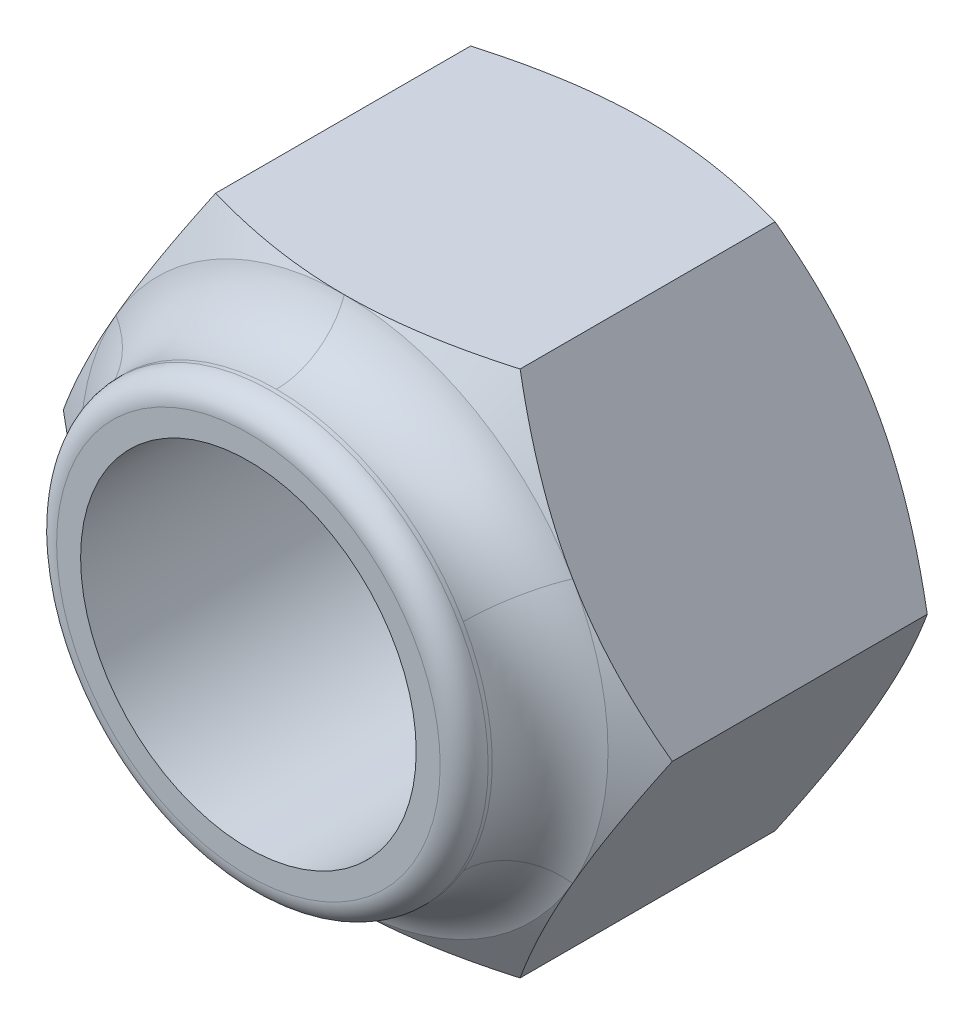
ISO-10303-21;
HEADER;
FILE_DESCRIPTION(('STEP AP214'),'2;1');
FILE_NAME('part.step','',(''),(''),'','','');
FILE_SCHEMA(('AUTOMOTIVE_DESIGN { 1 0 10303 214 1 1 1 1 }'));
ENDSEC;
DATA;
#1=APPLICATION_CONTEXT('core data for automotive mechanical design processes');
#2=APPLICATION_PROTOCOL_DEFINITION('international standard','automotive_design',2000,#1);
#3=PRODUCT_CONTEXT('',#1,'mechanical');
#4=PRODUCT('Part','Part','',(#3));
#5=PRODUCT_RELATED_PRODUCT_CATEGORY('part','',(#4));
#6=PRODUCT_DEFINITION_FORMATION('','',#4);
#7=PRODUCT_DEFINITION_CONTEXT('part definition',#1,'design');
#8=PRODUCT_DEFINITION('design','',#6,#7);
#9=PRODUCT_DEFINITION_SHAPE('','',#8);
#10=(LENGTH_UNIT() NAMED_UNIT(*) SI_UNIT(.MILLI.,.METRE.));
#11=(NAMED_UNIT(*) PLANE_ANGLE_UNIT() SI_UNIT($,.RADIAN.));
#12=(NAMED_UNIT(*) SI_UNIT($,.STERADIAN.) SOLID_ANGLE_UNIT());
#13=UNCERTAINTY_MEASURE_WITH_UNIT(LENGTH_MEASURE(1.E-05),#10,'distance_accuracy_value','');
#14=(GEOMETRIC_REPRESENTATION_CONTEXT(3) GLOBAL_UNCERTAINTY_ASSIGNED_CONTEXT((#13)) GLOBAL_UNIT_ASSIGNED_CONTEXT((#10,
#11,#12)) REPRESENTATION_CONTEXT('',''));
#15=CARTESIAN_POINT('',(0.,0.,0.));
#16=DIRECTION('',(0.,0.,1.));
#17=DIRECTION('',(1.,0.,0.));
#18=AXIS2_PLACEMENT_3D('',#15,#16,#17);
#19=CARTESIAN_POINT('',(-12.7017059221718,0.,12.6));
#20=DIRECTION('',(-0.866025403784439,0.5,0.));
#21=DIRECTION('',(-0.5,-0.866025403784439,0.));
#22=AXIS2_PLACEMENT_3D('',#19,#20,#21);
#23=PLANE('',#22);
#24=DIRECTION('',(0.,0.,-1.));
#25=VECTOR('',#24,1.);
#26=CARTESIAN_POINT('',(-12.7017059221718,0.,12.6));
#27=LINE('',#26,#25);
#28=CARTESIAN_POINT('',(-12.7017059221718,0.,11.6175196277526));
#29=VERTEX_POINT('',#28);
#30=CARTESIAN_POINT('',(-12.7017059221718,0.,0.982480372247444));
#31=VERTEX_POINT('',#30);
#32=EDGE_CURVE('E167',#29,#31,#27,.T.);
#33=ORIENTED_EDGE('',*,*,#32,.F.);
#34=CARTESIAN_POINT('',(-12.7018213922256,-0.000200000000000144,11.6174529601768));
#35=CARTESIAN_POINT('',(-12.5622159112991,0.241603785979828,11.6980408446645));
#36=CARTESIAN_POINT('',(-12.4220899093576,0.484309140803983,11.7749710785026));
#37=CARTESIAN_POINT('',(-12.1407142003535,0.971666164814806,11.9205013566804));
#38=CARTESIAN_POINT('',(-11.999464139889,1.21631844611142,11.9890986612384));
#39=CARTESIAN_POINT('',(-11.5734380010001,1.9542173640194,12.1810636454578));
#40=CARTESIAN_POINT('',(-11.2869801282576,2.45037695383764,12.2902522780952));
#41=CARTESIAN_POINT('',(-10.8583090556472,3.19285703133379,12.4182858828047));
#42=CARTESIAN_POINT('',(-10.7173765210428,3.43695934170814,12.4547577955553));
#43=CARTESIAN_POINT('',(-10.4348589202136,3.92629418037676,12.515918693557));
#44=CARTESIAN_POINT('',(-10.2932738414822,4.17152673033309,12.5406074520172));
#45=CARTESIAN_POINT('',(-10.0098676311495,4.66240068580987,12.5775696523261));
#46=CARTESIAN_POINT('',(-9.86804698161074,4.9080412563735,12.5898578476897));
#47=CARTESIAN_POINT('',(-9.58427426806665,5.39955001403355,12.6017570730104));
#48=CARTESIAN_POINT('',(-9.44232220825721,5.64541819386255,12.6013684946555));
#49=CARTESIAN_POINT('',(-9.17694200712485,6.10507018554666,12.5887988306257));
#50=CARTESIAN_POINT('',(-9.05349494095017,6.31888677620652,12.5781509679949));
#51=CARTESIAN_POINT('',(-8.80688473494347,6.74602818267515,12.5474683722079));
#52=CARTESIAN_POINT('',(-8.68372161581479,6.95935296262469,12.5274329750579));
#53=CARTESIAN_POINT('',(-8.43774623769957,7.3853948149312,12.4783246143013));
#54=CARTESIAN_POINT('',(-8.31493435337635,7.5981112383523,12.449244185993));
#55=CARTESIAN_POINT('',(-8.0698863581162,8.02254681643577,12.3825560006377));
#56=CARTESIAN_POINT('',(-7.94765028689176,8.23426590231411,12.3449476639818));
#57=CARTESIAN_POINT('',(-7.57659579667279,8.87695113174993,12.2183800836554));
#58=CARTESIAN_POINT('',(-7.32885191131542,9.30605612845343,12.1168005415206));
#59=CARTESIAN_POINT('',(-6.83705838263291,10.1578675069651,11.8862563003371));
#60=CARTESIAN_POINT('',(-6.59300244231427,10.580584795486,11.7573457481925));
#61=CARTESIAN_POINT('',(-6.35073749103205,11.0002,11.6174529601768));
#62=B_SPLINE_CURVE_WITH_KNOTS('',3,(#34,#35,#36,#37,#38,#39,#40,#41,#42,#43,#44,#45,#46,#47,#48,
#49,#50,#51,#52,#53,#54,#55,#56,#57,#58,#59,#60,#61),.UNSPECIFIED.,.F.,.F.,(4,2,2,2,2,2,2,2,2,2,
2,2,2,4),(0.,0.871755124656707,1.74379610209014,3.49159027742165,4.34403665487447,
5.19649943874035,6.0479468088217,6.89936787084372,7.64056020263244,8.38180496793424,
9.1236630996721,9.86557166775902,11.3820155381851,12.8954827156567),.UNSPECIFIED.);
#63=CARTESIAN_POINT('',(-9.52627944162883,5.5,12.6));
#64=VERTEX_POINT('',#63);
#65=EDGE_CURVE('E147',#29,#64,#62,.T.);
#66=ORIENTED_EDGE('',*,*,#65,.T.);
#67=CARTESIAN_POINT('',(-6.35085296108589,11.,11.6175196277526));
#68=VERTEX_POINT('',#67);
#69=EDGE_CURVE('E137',#64,#68,#62,.T.);
#70=ORIENTED_EDGE('',*,*,#69,.T.);
#71=DIRECTION('',(0.,0.,-1.));
#72=VECTOR('',#71,1.);
#73=CARTESIAN_POINT('',(-6.35085296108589,11.,12.6));
#74=LINE('',#73,#72);
#75=CARTESIAN_POINT('',(-6.35085296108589,11.,0.982480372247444));
#76=VERTEX_POINT('',#75);
#77=EDGE_CURVE('E308',#68,#76,#74,.T.);
#78=ORIENTED_EDGE('',*,*,#77,.T.);
#79=CARTESIAN_POINT('',(-6.35073749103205,11.0002,0.982547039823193));
#80=CARTESIAN_POINT('',(-6.49034297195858,10.7583962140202,0.901959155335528));
#81=CARTESIAN_POINT('',(-6.63046897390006,10.515690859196,0.825028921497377));
#82=CARTESIAN_POINT('',(-6.91184468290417,10.0283338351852,0.679498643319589));
#83=CARTESIAN_POINT('',(-7.05309474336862,9.78368155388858,0.610901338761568));
#84=CARTESIAN_POINT('',(-7.47912088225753,9.0457826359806,0.418936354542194));
#85=CARTESIAN_POINT('',(-7.76557875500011,8.54962304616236,0.309747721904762));
#86=CARTESIAN_POINT('',(-8.19424982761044,7.80714296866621,0.181714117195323));
#87=CARTESIAN_POINT('',(-8.33518236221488,7.56304065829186,0.145242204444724));
#88=CARTESIAN_POINT('',(-8.61769996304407,7.07370581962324,0.0840813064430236));
#89=CARTESIAN_POINT('',(-8.75928504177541,6.82847326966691,0.0593925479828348));
#90=CARTESIAN_POINT('',(-9.04269125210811,6.33759931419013,0.0224303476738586));
#91=CARTESIAN_POINT('',(-9.18451190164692,6.0919587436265,0.0101421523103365));
#92=CARTESIAN_POINT('',(-9.468284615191,5.60044998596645,-0.0017570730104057));
#93=CARTESIAN_POINT('',(-9.61023667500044,5.35458180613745,-0.00136849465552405));
#94=CARTESIAN_POINT('',(-9.87561687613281,4.89492981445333,0.0112011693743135));
#95=CARTESIAN_POINT('',(-9.99906394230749,4.68111322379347,0.02184903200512));
#96=CARTESIAN_POINT('',(-10.2456741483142,4.25397181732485,0.0525316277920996));
#97=CARTESIAN_POINT('',(-10.3688372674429,4.04064703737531,0.072567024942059));
#98=CARTESIAN_POINT('',(-10.6148126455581,3.6146051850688,0.121675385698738));
#99=CARTESIAN_POINT('',(-10.7376245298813,3.4018887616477,0.150755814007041));
#100=CARTESIAN_POINT('',(-10.9826725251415,2.97745318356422,0.2174439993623));
#101=CARTESIAN_POINT('',(-11.1049085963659,2.76573409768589,0.255052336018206));
#102=CARTESIAN_POINT('',(-11.4759630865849,2.12304886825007,0.381619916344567));
#103=CARTESIAN_POINT('',(-11.7237069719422,1.69394387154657,0.483199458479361));
#104=CARTESIAN_POINT('',(-12.2155005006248,0.84213249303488,0.713743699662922));
#105=CARTESIAN_POINT('',(-12.4595564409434,0.419415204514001,0.842654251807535));
#106=CARTESIAN_POINT('',(-12.7018213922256,-0.000199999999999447,0.982547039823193));
#107=B_SPLINE_CURVE_WITH_KNOTS('',3,(#79,#80,#81,#82,#83,#84,#85,#86,#87,#88,#89,#90,#91,#92,
#93,#94,#95,#96,#97,#98,#99,#100,#101,#102,#103,#104,#105,#106),.UNSPECIFIED.,.F.,.F.,(4,2,2,2,
2,2,2,2,2,2,2,2,2,4),(0.,0.871755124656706,1.74379610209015,3.49159027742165,4.34403665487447,
5.19649943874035,6.0479468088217,6.89936787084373,7.64056020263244,8.38180496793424,
9.1236630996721,9.86557166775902,11.3820155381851,12.8954827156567),.UNSPECIFIED.);
#108=CARTESIAN_POINT('',(-9.52627944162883,5.5,0.));
#109=VERTEX_POINT('',#108);
#110=EDGE_CURVE('E304',#76,#109,#107,.T.);
#111=ORIENTED_EDGE('',*,*,#110,.T.);
#112=EDGE_CURVE('E299',#109,#31,#107,.T.);
#113=ORIENTED_EDGE('',*,*,#112,.T.);
#114=EDGE_LOOP('',(#33,#66,#70,#78,#111,#113));
#115=FACE_BOUND('',#114,.T.);
#116=ADVANCED_FACE('F30',(#115),#23,.T.);
#117=CARTESIAN_POINT('',(-6.35085296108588,-11.,12.6));
#118=DIRECTION('',(-0.866025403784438,-0.5,0.));
#119=DIRECTION('',(0.5,-0.866025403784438,0.));
#120=AXIS2_PLACEMENT_3D('',#117,#118,#119);
#121=PLANE('',#120);
#122=DIRECTION('',(0.,0.,-1.));
#123=VECTOR('',#122,1.);
#124=CARTESIAN_POINT('',(-6.35085296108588,-11.,12.6));
#125=LINE('',#124,#123);
#126=CARTESIAN_POINT('',(-6.35085296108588,-11.,11.6175196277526));
#127=VERTEX_POINT('',#126);
#128=CARTESIAN_POINT('',(-6.35085296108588,-11.,0.982480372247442));
#129=VERTEX_POINT('',#128);
#130=EDGE_CURVE('E310',#127,#129,#125,.T.);
#131=ORIENTED_EDGE('',*,*,#130,.F.);
#132=CARTESIAN_POINT('',(-6.35073749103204,-11.0002,11.6174529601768));
#133=CARTESIAN_POINT('',(-6.49034297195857,-10.7583962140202,11.6980408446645));
#134=CARTESIAN_POINT('',(-6.63046897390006,-10.515690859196,11.7749710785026));
#135=CARTESIAN_POINT('',(-6.91184468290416,-10.0283338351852,11.9205013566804));
#136=CARTESIAN_POINT('',(-7.05309474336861,-9.78368155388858,11.9890986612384));
#137=CARTESIAN_POINT('',(-7.47912088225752,-9.0457826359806,12.1810636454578));
#138=CARTESIAN_POINT('',(-7.7655787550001,-8.54962304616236,12.2902522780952));
#139=CARTESIAN_POINT('',(-8.19424982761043,-7.80714296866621,12.4182858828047));
#140=CARTESIAN_POINT('',(-8.33518236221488,-7.56304065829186,12.4547577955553));
#141=CARTESIAN_POINT('',(-8.61769996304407,-7.07370581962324,12.515918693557));
#142=CARTESIAN_POINT('',(-8.75928504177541,-6.82847326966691,12.5406074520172));
#143=CARTESIAN_POINT('',(-9.04269125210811,-6.33759931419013,12.5775696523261));
#144=CARTESIAN_POINT('',(-9.18451190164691,-6.0919587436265,12.5898578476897));
#145=CARTESIAN_POINT('',(-9.468284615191,-5.60044998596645,12.6017570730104));
#146=CARTESIAN_POINT('',(-9.61023667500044,-5.35458180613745,12.6013684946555));
#147=CARTESIAN_POINT('',(-9.87561687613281,-4.89492981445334,12.5887988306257));
#148=CARTESIAN_POINT('',(-9.99906394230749,-4.68111322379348,12.5781509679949));
#149=CARTESIAN_POINT('',(-10.2456741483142,-4.25397181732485,12.5474683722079));
#150=CARTESIAN_POINT('',(-10.3688372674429,-4.04064703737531,12.5274329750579));
#151=CARTESIAN_POINT('',(-10.6148126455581,-3.6146051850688,12.4783246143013));
#152=CARTESIAN_POINT('',(-10.7376245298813,-3.4018887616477,12.449244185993));
#153=CARTESIAN_POINT('',(-10.9826725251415,-2.97745318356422,12.3825560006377));
#154=CARTESIAN_POINT('',(-11.1049085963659,-2.76573409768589,12.3449476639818));
#155=CARTESIAN_POINT('',(-11.4759630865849,-2.12304886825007,12.2183800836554));
#156=CARTESIAN_POINT('',(-11.7237069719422,-1.69394387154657,12.1168005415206));
#157=CARTESIAN_POINT('',(-12.2155005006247,-0.842132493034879,11.8862563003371));
#158=CARTESIAN_POINT('',(-12.4595564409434,-0.419415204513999,11.7573457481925));
#159=CARTESIAN_POINT('',(-12.7018213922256,0.000199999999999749,11.6174529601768));
#160=B_SPLINE_CURVE_WITH_KNOTS('',3,(#132,#133,#134,#135,#136,#137,#138,#139,#140,#141,#142,
#143,#144,#145,#146,#147,#148,#149,#150,#151,#152,#153,#154,#155,#156,#157,#158,#159),
.UNSPECIFIED.,.F.,.F.,(4,2,2,2,2,2,2,2,2,2,2,2,2,4),(0.,0.871755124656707,1.74379610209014,
3.49159027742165,4.34403665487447,5.19649943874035,6.0479468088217,6.89936787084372,
7.64056020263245,8.38180496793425,9.1236630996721,9.86557166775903,11.3820155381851,
12.8954827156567),.UNSPECIFIED.);
#161=CARTESIAN_POINT('',(-9.52627944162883,-5.50000000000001,12.6));
#162=VERTEX_POINT('',#161);
#163=EDGE_CURVE('E268',#127,#162,#160,.T.);
#164=ORIENTED_EDGE('',*,*,#163,.T.);
#165=EDGE_CURVE('E156',#162,#29,#160,.T.);
#166=ORIENTED_EDGE('',*,*,#165,.T.);
#167=ORIENTED_EDGE('',*,*,#32,.T.);
#168=CARTESIAN_POINT('',(-12.7018213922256,0.0002,0.982547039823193));
#169=CARTESIAN_POINT('',(-12.5622159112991,-0.241603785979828,0.901959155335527));
#170=CARTESIAN_POINT('',(-12.4220899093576,-0.484309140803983,0.825028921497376));
#171=CARTESIAN_POINT('',(-12.1407142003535,-0.971666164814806,0.679498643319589));
#172=CARTESIAN_POINT('',(-11.999464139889,-1.21631844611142,0.610901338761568));
#173=CARTESIAN_POINT('',(-11.5734380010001,-1.9542173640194,0.418936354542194));
#174=CARTESIAN_POINT('',(-11.2869801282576,-2.45037695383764,0.309747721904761));
#175=CARTESIAN_POINT('',(-10.8583090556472,-3.19285703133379,0.181714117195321));
#176=CARTESIAN_POINT('',(-10.7173765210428,-3.43695934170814,0.145242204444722));
#177=CARTESIAN_POINT('',(-10.4348589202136,-3.92629418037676,0.0840813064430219));
#178=CARTESIAN_POINT('',(-10.2932738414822,-4.17152673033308,0.0593925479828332));
#179=CARTESIAN_POINT('',(-10.0098676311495,-4.66240068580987,0.0224303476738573));
#180=CARTESIAN_POINT('',(-9.86804698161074,-4.9080412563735,0.0101421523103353));
#181=CARTESIAN_POINT('',(-9.58427426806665,-5.39955001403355,-0.00175707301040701));
#182=CARTESIAN_POINT('',(-9.44232220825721,-5.64541819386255,-0.00136849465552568));
#183=CARTESIAN_POINT('',(-9.17694200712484,-6.10507018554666,0.0112011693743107));
#184=CARTESIAN_POINT('',(-9.05349494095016,-6.31888677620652,0.0218490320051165));
#185=CARTESIAN_POINT('',(-8.80688473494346,-6.74602818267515,0.0525316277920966));
#186=CARTESIAN_POINT('',(-8.68372161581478,-6.95935296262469,0.0725670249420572));
#187=CARTESIAN_POINT('',(-8.43774623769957,-7.3853948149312,0.121675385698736));
#188=CARTESIAN_POINT('',(-8.31493435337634,-7.5981112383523,0.150755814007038));
#189=CARTESIAN_POINT('',(-8.0698863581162,-8.02254681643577,0.217443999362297));
#190=CARTESIAN_POINT('',(-7.94765028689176,-8.23426590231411,0.255052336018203));
#191=CARTESIAN_POINT('',(-7.57659579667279,-8.87695113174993,0.381619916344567));
#192=CARTESIAN_POINT('',(-7.32885191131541,-9.30605612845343,0.483199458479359));
#193=CARTESIAN_POINT('',(-6.8370583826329,-10.1578675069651,0.713743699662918));
#194=CARTESIAN_POINT('',(-6.59300244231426,-10.580584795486,0.84265425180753));
#195=CARTESIAN_POINT('',(-6.35073749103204,-11.0002,0.98254703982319));
#196=B_SPLINE_CURVE_WITH_KNOTS('',3,(#168,#169,#170,#171,#172,#173,#174,#175,#176,#177,#178,
#179,#180,#181,#182,#183,#184,#185,#186,#187,#188,#189,#190,#191,#192,#193,#194,#195),
.UNSPECIFIED.,.F.,.F.,(4,2,2,2,2,2,2,2,2,2,2,2,2,4),(0.,0.871755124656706,1.74379610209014,
3.49159027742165,4.34403665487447,5.19649943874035,6.0479468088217,6.89936787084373,
7.64056020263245,8.38180496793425,9.1236630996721,9.86557166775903,11.3820155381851,
12.8954827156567),.UNSPECIFIED.);
#197=CARTESIAN_POINT('',(-9.52627944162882,-5.5,0.));
#198=VERTEX_POINT('',#197);
#199=EDGE_CURVE('E292',#31,#198,#196,.T.);
#200=ORIENTED_EDGE('',*,*,#199,.T.);
#201=EDGE_CURVE('E285',#198,#129,#196,.T.);
#202=ORIENTED_EDGE('',*,*,#201,.T.);
#203=EDGE_LOOP('',(#131,#164,#166,#167,#200,#202));
#204=FACE_BOUND('',#203,.T.);
#205=ADVANCED_FACE('F275',(#204),#121,.T.);
#206=CARTESIAN_POINT('',(6.35085296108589,-11.,12.6));
#207=DIRECTION('',(0.,-1.,0.));
#208=DIRECTION('',(0.,0.,-1.));
#209=AXIS2_PLACEMENT_3D('',#206,#207,#208);
#210=PLANE('',#209);
#211=DIRECTION('',(0.,0.,-1.));
#212=VECTOR('',#211,1.);
#213=CARTESIAN_POINT('',(6.35085296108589,-11.,12.6));
#214=LINE('',#213,#212);
#215=CARTESIAN_POINT('',(6.35085296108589,-11.,11.6175196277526));
#216=VERTEX_POINT('',#215);
#217=CARTESIAN_POINT('',(6.35085296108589,-11.,0.982480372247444));
#218=VERTEX_POINT('',#217);
#219=EDGE_CURVE('E312',#216,#218,#214,.T.);
#220=ORIENTED_EDGE('',*,*,#219,.F.);
#221=CARTESIAN_POINT('',(-16.8715144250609,-11.,7.32261149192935));
#222=CARTESIAN_POINT('',(-16.6299324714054,-11.,7.43944681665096));
#223=CARTESIAN_POINT('',(-16.3880593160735,-11.,7.55567972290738));
#224=CARTESIAN_POINT('',(-15.9036690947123,-11.,7.78680248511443));
#225=CARTESIAN_POINT('',(-15.6611520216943,-11.,7.90169232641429));
#226=CARTESIAN_POINT('',(-14.9324720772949,-11.,8.24417301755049));
#227=CARTESIAN_POINT('',(-14.4452585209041,-11.,8.46953718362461));
#228=CARTESIAN_POINT('',(-13.4647004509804,-11.,8.91416195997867));
#229=CARTESIAN_POINT('',(-12.9713368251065,-11.,9.13338052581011));
#230=CARTESIAN_POINT('',(-11.9805654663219,-11.,9.56244584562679));
#231=CARTESIAN_POINT('',(-11.4831579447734,-11.,9.77229308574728));
#232=CARTESIAN_POINT('',(-10.4772023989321,-11.,10.182663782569));
#233=CARTESIAN_POINT('',(-9.96859289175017,-11.,10.3830373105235));
#234=CARTESIAN_POINT('',(-8.9453812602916,-11.,10.7681619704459));
#235=CARTESIAN_POINT('',(-8.43077847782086,-11.,10.9529113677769));
#236=CARTESIAN_POINT('',(-7.39582607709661,-11.,11.3018415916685));
#237=CARTESIAN_POINT('',(-6.8754912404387,-11.,11.4660659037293));
#238=CARTESIAN_POINT('',(-5.8273730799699,-11.,11.7686389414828));
#239=CARTESIAN_POINT('',(-5.29959215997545,-11.,11.9069958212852));
#240=CARTESIAN_POINT('',(-4.50223799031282,-11.,12.0900781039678));
#241=CARTESIAN_POINT('',(-4.23545580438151,-11.,12.1470383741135));
#242=CARTESIAN_POINT('',(-3.70011001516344,-11.,12.2519122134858));
#243=CARTESIAN_POINT('',(-3.43154645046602,-11.,12.2998259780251));
#244=CARTESIAN_POINT('',(-2.89281076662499,-11.,12.3857598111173));
#245=CARTESIAN_POINT('',(-2.62263851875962,-11.,12.4237790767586));
#246=CARTESIAN_POINT('',(-2.08100944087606,-11.,12.4891585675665));
#247=CARTESIAN_POINT('',(-1.80955266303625,-11.,12.5165192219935));
#248=CARTESIAN_POINT('',(-1.26747354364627,-11.,12.5598460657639));
#249=CARTESIAN_POINT('',(-0.996856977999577,-11.,12.5758840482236));
#250=CARTESIAN_POINT('',(-0.45518803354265,-11.,12.596479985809));
#251=CARTESIAN_POINT('',(-0.184135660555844,-11.,12.6010380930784));
#252=CARTESIAN_POINT('',(0.357840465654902,-11.,12.5985659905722));
#253=CARTESIAN_POINT('',(0.628764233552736,-11.,12.5915390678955));
#254=CARTESIAN_POINT('',(1.17007877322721,-11.,12.5660723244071));
#255=CARTESIAN_POINT('',(1.44046951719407,-11.,12.5476319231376));
#256=CARTESIAN_POINT('',(2.09491286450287,-11.,12.4895726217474));
#257=CARTESIAN_POINT('',(2.47847090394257,-11.,12.4442854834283));
#258=CARTESIAN_POINT('',(3.24266678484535,-11.,12.3332516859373));
#259=CARTESIAN_POINT('',(3.62330380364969,-11.,12.2674994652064));
#260=CARTESIAN_POINT('',(4.38133729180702,-11.,12.1178672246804));
#261=CARTESIAN_POINT('',(4.7587303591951,-11.,12.0339701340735));
#262=CARTESIAN_POINT('',(5.50964256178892,-11.,11.8506095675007));
#263=CARTESIAN_POINT('',(5.88316205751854,-11.,11.7511475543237));
#264=CARTESIAN_POINT('',(6.63556541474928,-11.,11.5364273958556));
#265=CARTESIAN_POINT('',(7.01435481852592,-11.,11.4208405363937));
#266=CARTESIAN_POINT('',(7.76793042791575,-11.,11.1781863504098));
#267=CARTESIAN_POINT('',(8.14271919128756,-11.,11.0511269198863));
#268=CARTESIAN_POINT('',(8.88679018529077,-11.,10.7881571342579));
#269=CARTESIAN_POINT('',(9.25609152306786,-11.,10.652300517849));
#270=CARTESIAN_POINT('',(9.99182385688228,-11.,10.372574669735));
#271=CARTESIAN_POINT('',(10.3582536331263,-11.,10.2287022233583));
#272=CARTESIAN_POINT('',(10.7233495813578,-11.,10.0816134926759));
#273=B_SPLINE_CURVE_WITH_KNOTS('',3,(#221,#222,#223,#224,#225,#226,#227,#228,#229,#230,#231,
#232,#233,#234,#235,#236,#237,#238,#239,#240,#241,#242,#243,#244,#245,#246,#247,#248,#249,#250,
#251,#252,#253,#254,#255,#256,#257,#258,#259,#260,#261,#262,#263,#264,#265,#266,#267,#268,#269,
#270,#271,#272),.UNSPECIFIED.,.F.,.F.,(4,2,2,2,2,2,2,2,2,2,2,2,2,2,2,2,2,2,2,2,2,2,2,2,2,4),(0.,
0.805051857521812,1.61011248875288,3.22049394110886,4.84004195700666,6.45950586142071,
8.09927891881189,9.73923379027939,11.3756530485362,13.0115555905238,13.8298124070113,
14.6480515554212,15.4663570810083,16.2846296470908,17.0976660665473,17.9106917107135,
18.72348670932,19.5363230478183,20.6943454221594,21.852682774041,23.0121146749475,
24.1714376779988,25.3593140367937,26.546378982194,27.7267745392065,28.907646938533),.UNSPECIFIED.);
#274=CARTESIAN_POINT('',(0.,-11.,12.6));
#275=VERTEX_POINT('',#274);
#276=EDGE_CURVE('E345',#216,#275,#273,.F.);
#277=ORIENTED_EDGE('',*,*,#276,.T.);
#278=EDGE_CURVE('E269',#275,#127,#273,.F.);
#279=ORIENTED_EDGE('',*,*,#278,.T.);
#280=ORIENTED_EDGE('',*,*,#130,.T.);
#281=CARTESIAN_POINT('',(-16.8595704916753,-11.,5.27161260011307));
#282=CARTESIAN_POINT('',(-16.6180352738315,-11.,5.15482456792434));
#283=CARTESIAN_POINT('',(-16.3762085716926,-11.,5.03863966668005));
#284=CARTESIAN_POINT('',(-15.8919106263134,-11.,4.80761453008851));
#285=CARTESIAN_POINT('',(-15.6494393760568,-11.,4.69277430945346));
#286=CARTESIAN_POINT('',(-14.9208956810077,-11.,4.35044511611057));
#287=CARTESIAN_POINT('',(-14.433771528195,-11.,4.12518555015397));
#288=CARTESIAN_POINT('',(-13.4533832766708,-11.,3.68077701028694));
#289=CARTESIAN_POINT('',(-12.9601000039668,-11.,3.46167022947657));
#290=CARTESIAN_POINT('',(-11.9694856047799,-11.,3.03284082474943));
#291=CARTESIAN_POINT('',(-11.4721546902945,-11.,2.82311771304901));
#292=CARTESIAN_POINT('',(-10.4664050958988,-11.,2.41303562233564));
#293=CARTESIAN_POINT('',(-9.957925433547,-11.,2.21282542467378));
#294=CARTESIAN_POINT('',(-8.93497076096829,-11.,1.82804438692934));
#295=CARTESIAN_POINT('',(-8.42049509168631,-11.,1.64347528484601));
#296=CARTESIAN_POINT('',(-7.38579811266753,-11.,1.29492646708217));
#297=CARTESIAN_POINT('',(-6.86559162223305,-11.,1.13090311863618));
#298=CARTESIAN_POINT('',(-5.81773244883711,-11.,0.82875412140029));
#299=CARTESIAN_POINT('',(-5.29008217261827,-11.,0.690620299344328));
#300=CARTESIAN_POINT('',(-4.49292479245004,-11.,0.507886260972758));
#301=CARTESIAN_POINT('',(-4.22620569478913,-11.,0.45104393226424));
#302=CARTESIAN_POINT('',(-3.69098889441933,-11.,0.346410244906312));
#303=CARTESIAN_POINT('',(-3.42249123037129,-11.,0.298618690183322));
#304=CARTESIAN_POINT('',(-2.88389101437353,-11.,0.212932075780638));
#305=CARTESIAN_POINT('',(-2.6137883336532,-11.,0.175037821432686));
#306=CARTESIAN_POINT('',(-2.07230289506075,-11.,0.109909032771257));
#307=CARTESIAN_POINT('',(-1.80092018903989,-11.,0.0826740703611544));
#308=CARTESIAN_POINT('',(-1.25898626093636,-11.,0.0395952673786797));
#309=CARTESIAN_POINT('',(-0.988440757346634,-11.,0.0236799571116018));
#310=CARTESIAN_POINT('',(-0.44691909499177,-11.,0.00332520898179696));
#311=CARTESIAN_POINT('',(-0.175942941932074,-11.,-0.00111437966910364));
#312=CARTESIAN_POINT('',(0.365876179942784,-11.,0.00158772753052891));
#313=CARTESIAN_POINT('',(0.636719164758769,-11.,0.00872615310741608));
#314=CARTESIAN_POINT('',(1.17786777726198,-11.,0.0344064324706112));
#315=CARTESIAN_POINT('',(1.44817337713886,-11.,0.0529488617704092));
#316=CARTESIAN_POINT('',(2.10279230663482,-11.,0.111276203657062));
#317=CARTESIAN_POINT('',(2.48660744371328,-11.,0.15674594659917));
#318=CARTESIAN_POINT('',(3.251307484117,-11.,0.268158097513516));
#319=CARTESIAN_POINT('',(3.63219156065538,-11.,0.33410607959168));
#320=CARTESIAN_POINT('',(4.39071162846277,-11.,0.484135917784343));
#321=CARTESIAN_POINT('',(4.76834420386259,-11.,0.56823488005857));
#322=CARTESIAN_POINT('',(5.51972917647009,-11.,0.751999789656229));
#323=CARTESIAN_POINT('',(5.8934819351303,-11.,0.851664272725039));
#324=CARTESIAN_POINT('',(6.64633498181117,-11.,1.06678647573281));
#325=CARTESIAN_POINT('',(7.02534090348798,-11.,1.18257217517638));
#326=CARTESIAN_POINT('',(7.77934699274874,-11.,1.42561830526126));
#327=CARTESIAN_POINT('',(8.15434972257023,-11.,1.55287083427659));
#328=CARTESIAN_POINT('',(8.89884499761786,-11.,1.81621921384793));
#329=CARTESIAN_POINT('',(9.26835666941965,-11.,1.95226131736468));
#330=CARTESIAN_POINT('',(10.0045101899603,-11.,2.23235264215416));
#331=CARTESIAN_POINT('',(10.3711508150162,-11.,2.37640508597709));
#332=CARTESIAN_POINT('',(10.736457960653,-11.,2.52367105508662));
#333=B_SPLINE_CURVE_WITH_KNOTS('',3,(#281,#282,#283,#284,#285,#286,#287,#288,#289,#290,#291,
#292,#293,#294,#295,#296,#297,#298,#299,#300,#301,#302,#303,#304,#305,#306,#307,#308,#309,#310,
#311,#312,#313,#314,#315,#316,#317,#318,#319,#320,#321,#322,#323,#324,#325,#326,#327,#328,#329,
#330,#331,#332),.UNSPECIFIED.,.F.,.F.,(4,2,2,2,2,2,2,2,2,2,2,2,2,2,2,2,2,2,2,2,2,2,2,2,2,4),(0.,
0.804863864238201,1.60973652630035,3.21974268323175,4.83893404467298,6.45804113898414,
8.09727172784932,9.73668422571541,11.3725538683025,13.0079061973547,13.8259039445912,
14.6438839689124,15.4619305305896,16.2799442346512,17.0927462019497,17.9055374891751,
18.7180992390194,19.5307019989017,20.6895539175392,21.8487215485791,23.0089864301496,
24.1691422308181,25.3578143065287,26.545673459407,27.7268535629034,28.9085123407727),.UNSPECIFIED.);
#334=CARTESIAN_POINT('',(0.,-11.,0.));
#335=VERTEX_POINT('',#334);
#336=EDGE_CURVE('E293',#129,#335,#333,.T.);
#337=ORIENTED_EDGE('',*,*,#336,.T.);
#338=EDGE_CURVE('E294',#335,#218,#333,.T.);
#339=ORIENTED_EDGE('',*,*,#338,.T.);
#340=EDGE_LOOP('',(#220,#277,#279,#280,#337,#339));
#341=FACE_BOUND('',#340,.T.);
#342=ADVANCED_FACE('F279',(#341),#210,.T.);
#343=CARTESIAN_POINT('',(12.7017059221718,0.,12.6));
#344=DIRECTION('',(0.866025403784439,-0.5,0.));
#345=DIRECTION('',(0.5,0.866025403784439,0.));
#346=AXIS2_PLACEMENT_3D('',#343,#344,#345);
#347=PLANE('',#346);
#348=DIRECTION('',(0.,0.,-1.));
#349=VECTOR('',#348,1.);
#350=CARTESIAN_POINT('',(12.7017059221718,0.,12.6));
#351=LINE('',#350,#349);
#352=CARTESIAN_POINT('',(12.7017059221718,0.,11.6175196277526));
#353=VERTEX_POINT('',#352);
#354=CARTESIAN_POINT('',(12.7017059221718,0.,0.982480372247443));
#355=VERTEX_POINT('',#354);
#356=EDGE_CURVE('E314',#353,#355,#351,.T.);
#357=ORIENTED_EDGE('',*,*,#356,.F.);
#358=CARTESIAN_POINT('',(12.7018213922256,0.000200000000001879,11.6174529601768));
#359=CARTESIAN_POINT('',(12.5622159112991,-0.241603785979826,11.6980408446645));
#360=CARTESIAN_POINT('',(12.4220899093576,-0.484309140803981,11.7749710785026));
#361=CARTESIAN_POINT('',(12.1407142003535,-0.971666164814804,11.9205013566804));
#362=CARTESIAN_POINT('',(11.999464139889,-1.21631844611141,11.9890986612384));
#363=CARTESIAN_POINT('',(11.5734380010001,-1.9542173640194,12.1810636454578));
#364=CARTESIAN_POINT('',(11.2869801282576,-2.45037695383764,12.2902522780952));
#365=CARTESIAN_POINT('',(10.8583090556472,-3.19285703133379,12.4182858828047));
#366=CARTESIAN_POINT('',(10.7173765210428,-3.43695934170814,12.4547577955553));
#367=CARTESIAN_POINT('',(10.4348589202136,-3.92629418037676,12.515918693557));
#368=CARTESIAN_POINT('',(10.2932738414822,-4.17152673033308,12.5406074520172));
#369=CARTESIAN_POINT('',(10.0098676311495,-4.66240068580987,12.5775696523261));
#370=CARTESIAN_POINT('',(9.86804698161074,-4.9080412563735,12.5898578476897));
#371=CARTESIAN_POINT('',(9.58427426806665,-5.39955001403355,12.6017570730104));
#372=CARTESIAN_POINT('',(9.44232220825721,-5.64541819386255,12.6013684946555));
#373=CARTESIAN_POINT('',(9.17694200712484,-6.10507018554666,12.5887988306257));
#374=CARTESIAN_POINT('',(9.05349494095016,-6.31888677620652,12.5781509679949));
#375=CARTESIAN_POINT('',(8.80688473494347,-6.74602818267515,12.5474683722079));
#376=CARTESIAN_POINT('',(8.68372161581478,-6.95935296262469,12.5274329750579));
#377=CARTESIAN_POINT('',(8.43774623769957,-7.3853948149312,12.4783246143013));
#378=CARTESIAN_POINT('',(8.31493435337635,-7.5981112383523,12.449244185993));
#379=CARTESIAN_POINT('',(8.0698863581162,-8.02254681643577,12.3825560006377));
#380=CARTESIAN_POINT('',(7.94765028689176,-8.23426590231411,12.3449476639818));
#381=CARTESIAN_POINT('',(7.57659579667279,-8.87695113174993,12.2183800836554));
#382=CARTESIAN_POINT('',(7.32885191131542,-9.30605612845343,12.1168005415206));
#383=CARTESIAN_POINT('',(6.83705838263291,-10.1578675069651,11.8862563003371));
#384=CARTESIAN_POINT('',(6.59300244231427,-10.580584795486,11.7573457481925));
#385=CARTESIAN_POINT('',(6.35073749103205,-11.0002,11.6174529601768));
#386=B_SPLINE_CURVE_WITH_KNOTS('',3,(#358,#359,#360,#361,#362,#363,#364,#365,#366,#367,#368,
#369,#370,#371,#372,#373,#374,#375,#376,#377,#378,#379,#380,#381,#382,#383,#384,#385),
.UNSPECIFIED.,.F.,.F.,(4,2,2,2,2,2,2,2,2,2,2,2,2,4),(0.,0.871755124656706,1.74379610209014,
3.49159027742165,4.34403665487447,5.19649943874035,6.0479468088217,6.89936787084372,
7.64056020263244,8.38180496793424,9.1236630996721,9.86557166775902,11.3820155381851,
12.8954827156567),.UNSPECIFIED.);
#387=CARTESIAN_POINT('',(9.52627944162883,-5.5,12.6));
#388=VERTEX_POINT('',#387);
#389=EDGE_CURVE('E258',#353,#388,#386,.T.);
#390=ORIENTED_EDGE('',*,*,#389,.T.);
#391=EDGE_CURVE('E352',#388,#216,#386,.T.);
#392=ORIENTED_EDGE('',*,*,#391,.T.);
#393=ORIENTED_EDGE('',*,*,#219,.T.);
#394=CARTESIAN_POINT('',(6.35073749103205,-11.0002,0.982547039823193));
#395=CARTESIAN_POINT('',(6.49034297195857,-10.7583962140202,0.901959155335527));
#396=CARTESIAN_POINT('',(6.63046897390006,-10.515690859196,0.825028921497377));
#397=CARTESIAN_POINT('',(6.91184468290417,-10.0283338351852,0.679498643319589));
#398=CARTESIAN_POINT('',(7.05309474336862,-9.78368155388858,0.610901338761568));
#399=CARTESIAN_POINT('',(7.47912088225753,-9.0457826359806,0.418936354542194));
#400=CARTESIAN_POINT('',(7.7655787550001,-8.54962304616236,0.309747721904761));
#401=CARTESIAN_POINT('',(8.19424982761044,-7.80714296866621,0.181714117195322));
#402=CARTESIAN_POINT('',(8.33518236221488,-7.56304065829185,0.145242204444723));
#403=CARTESIAN_POINT('',(8.61769996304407,-7.07370581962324,0.084081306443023));
#404=CARTESIAN_POINT('',(8.75928504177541,-6.82847326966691,0.0593925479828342));
#405=CARTESIAN_POINT('',(9.04269125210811,-6.33759931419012,0.0224303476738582));
#406=CARTESIAN_POINT('',(9.18451190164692,-6.0919587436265,0.0101421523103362));
#407=CARTESIAN_POINT('',(9.468284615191,-5.60044998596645,-0.00175707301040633));
#408=CARTESIAN_POINT('',(9.61023667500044,-5.35458180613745,-0.00136849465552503));
#409=CARTESIAN_POINT('',(9.87561687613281,-4.89492981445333,0.011201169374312));
#410=CARTESIAN_POINT('',(9.99906394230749,-4.68111322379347,0.0218490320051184));
#411=CARTESIAN_POINT('',(10.2456741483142,-4.25397181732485,0.0525316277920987));
#412=CARTESIAN_POINT('',(10.3688372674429,-4.04064703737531,0.072567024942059));
#413=CARTESIAN_POINT('',(10.6148126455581,-3.6146051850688,0.121675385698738));
#414=CARTESIAN_POINT('',(10.7376245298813,-3.4018887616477,0.150755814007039));
#415=CARTESIAN_POINT('',(10.9826725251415,-2.97745318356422,0.217443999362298));
#416=CARTESIAN_POINT('',(11.1049085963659,-2.76573409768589,0.255052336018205));
#417=CARTESIAN_POINT('',(11.4759630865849,-2.12304886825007,0.381619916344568));
#418=CARTESIAN_POINT('',(11.7237069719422,-1.69394387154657,0.48319945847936));
#419=CARTESIAN_POINT('',(12.2155005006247,-0.842132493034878,0.713743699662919));
#420=CARTESIAN_POINT('',(12.4595564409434,-0.419415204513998,0.842654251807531));
#421=CARTESIAN_POINT('',(12.7018213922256,0.000200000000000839,0.982547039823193));
#422=B_SPLINE_CURVE_WITH_KNOTS('',3,(#394,#395,#396,#397,#398,#399,#400,#401,#402,#403,#404,
#405,#406,#407,#408,#409,#410,#411,#412,#413,#414,#415,#416,#417,#418,#419,#420,#421),
.UNSPECIFIED.,.F.,.F.,(4,2,2,2,2,2,2,2,2,2,2,2,2,4),(0.,0.871755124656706,1.74379610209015,
3.49159027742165,4.34403665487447,5.19649943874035,6.0479468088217,6.89936787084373,
7.64056020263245,8.38180496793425,9.1236630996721,9.86557166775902,11.3820155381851,
12.8954827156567),.UNSPECIFIED.);
#423=CARTESIAN_POINT('',(9.52627944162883,-5.5,0.));
#424=VERTEX_POINT('',#423);
#425=EDGE_CURVE('E596',#218,#424,#422,.T.);
#426=ORIENTED_EDGE('',*,*,#425,.T.);
#427=EDGE_CURVE('E598',#424,#355,#422,.T.);
#428=ORIENTED_EDGE('',*,*,#427,.T.);
#429=EDGE_LOOP('',(#357,#390,#392,#393,#426,#428));
#430=FACE_BOUND('',#429,.T.);
#431=ADVANCED_FACE('F388',(#430),#347,.T.);
#432=CARTESIAN_POINT('',(6.35085296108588,11.,12.6));
#433=DIRECTION('',(0.866025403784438,0.5,0.));
#434=DIRECTION('',(-0.5,0.866025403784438,0.));
#435=AXIS2_PLACEMENT_3D('',#432,#433,#434);
#436=PLANE('',#435);
#437=DIRECTION('',(0.,0.,-1.));
#438=VECTOR('',#437,1.);
#439=CARTESIAN_POINT('',(6.35085296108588,11.,12.6));
#440=LINE('',#439,#438);
#441=CARTESIAN_POINT('',(6.35085296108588,11.,11.6175196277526));
#442=VERTEX_POINT('',#441);
#443=CARTESIAN_POINT('',(6.35085296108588,11.,0.982480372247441));
#444=VERTEX_POINT('',#443);
#445=EDGE_CURVE('E316',#442,#444,#440,.T.);
#446=ORIENTED_EDGE('',*,*,#445,.F.);
#447=CARTESIAN_POINT('',(6.35073749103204,11.0002,11.6174529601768));
#448=CARTESIAN_POINT('',(6.49034297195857,10.7583962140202,11.6980408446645));
#449=CARTESIAN_POINT('',(6.63046897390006,10.515690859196,11.7749710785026));
#450=CARTESIAN_POINT('',(6.91184468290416,10.0283338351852,11.9205013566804));
#451=CARTESIAN_POINT('',(7.05309474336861,9.78368155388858,11.9890986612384));
#452=CARTESIAN_POINT('',(7.47912088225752,9.0457826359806,12.1810636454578));
#453=CARTESIAN_POINT('',(7.7655787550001,8.54962304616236,12.2902522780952));
#454=CARTESIAN_POINT('',(8.19424982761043,7.80714296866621,12.4182858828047));
#455=CARTESIAN_POINT('',(8.33518236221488,7.56304065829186,12.4547577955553));
#456=CARTESIAN_POINT('',(8.61769996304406,7.07370581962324,12.515918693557));
#457=CARTESIAN_POINT('',(8.75928504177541,6.82847326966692,12.5406074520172));
#458=CARTESIAN_POINT('',(9.04269125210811,6.33759931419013,12.5775696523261));
#459=CARTESIAN_POINT('',(9.18451190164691,6.0919587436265,12.5898578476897));
#460=CARTESIAN_POINT('',(9.468284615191,5.60044998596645,12.6017570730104));
#461=CARTESIAN_POINT('',(9.61023667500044,5.35458180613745,12.6013684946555));
#462=CARTESIAN_POINT('',(9.87561687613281,4.89492981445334,12.5887988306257));
#463=CARTESIAN_POINT('',(9.99906394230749,4.68111322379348,12.5781509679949));
#464=CARTESIAN_POINT('',(10.2456741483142,4.25397181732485,12.5474683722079));
#465=CARTESIAN_POINT('',(10.3688372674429,4.04064703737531,12.5274329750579));
#466=CARTESIAN_POINT('',(10.6148126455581,3.6146051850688,12.4783246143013));
#467=CARTESIAN_POINT('',(10.7376245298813,3.4018887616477,12.449244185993));
#468=CARTESIAN_POINT('',(10.9826725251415,2.97745318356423,12.3825560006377));
#469=CARTESIAN_POINT('',(11.1049085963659,2.76573409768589,12.3449476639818));
#470=CARTESIAN_POINT('',(11.4759630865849,2.12304886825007,12.2183800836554));
#471=CARTESIAN_POINT('',(11.7237069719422,1.69394387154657,12.1168005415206));
#472=CARTESIAN_POINT('',(12.2155005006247,0.842132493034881,11.8862563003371));
#473=CARTESIAN_POINT('',(12.4595564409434,0.419415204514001,11.7573457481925));
#474=CARTESIAN_POINT('',(12.7018213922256,-0.000199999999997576,11.6174529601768));
#475=B_SPLINE_CURVE_WITH_KNOTS('',3,(#447,#448,#449,#450,#451,#452,#453,#454,#455,#456,#457,
#458,#459,#460,#461,#462,#463,#464,#465,#466,#467,#468,#469,#470,#471,#472,#473,#474),
.UNSPECIFIED.,.F.,.F.,(4,2,2,2,2,2,2,2,2,2,2,2,2,4),(0.,0.871755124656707,1.74379610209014,
3.49159027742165,4.34403665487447,5.19649943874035,6.0479468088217,6.89936787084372,
7.64056020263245,8.38180496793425,9.1236630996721,9.86557166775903,11.3820155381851,
12.8954827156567),.UNSPECIFIED.);
#476=CARTESIAN_POINT('',(9.52627944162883,5.50000000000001,12.6));
#477=VERTEX_POINT('',#476);
#478=EDGE_CURVE('E148',#442,#477,#475,.T.);
#479=ORIENTED_EDGE('',*,*,#478,.T.);
#480=EDGE_CURVE('E168',#477,#353,#475,.T.);
#481=ORIENTED_EDGE('',*,*,#480,.T.);
#482=ORIENTED_EDGE('',*,*,#356,.T.);
#483=CARTESIAN_POINT('',(12.7018213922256,-0.000199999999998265,0.982547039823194));
#484=CARTESIAN_POINT('',(12.5622159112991,0.24160378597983,0.901959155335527));
#485=CARTESIAN_POINT('',(12.4220899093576,0.484309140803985,0.825028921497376));
#486=CARTESIAN_POINT('',(12.1407142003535,0.971666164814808,0.679498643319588));
#487=CARTESIAN_POINT('',(11.999464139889,1.21631844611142,0.610901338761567));
#488=CARTESIAN_POINT('',(11.5734380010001,1.9542173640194,0.418936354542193));
#489=CARTESIAN_POINT('',(11.2869801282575,2.45037695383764,0.30974772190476));
#490=CARTESIAN_POINT('',(10.8583090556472,3.19285703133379,0.181714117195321));
#491=CARTESIAN_POINT('',(10.7173765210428,3.43695934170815,0.145242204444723));
#492=CARTESIAN_POINT('',(10.4348589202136,3.92629418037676,0.0840813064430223));
#493=CARTESIAN_POINT('',(10.2932738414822,4.17152673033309,0.0593925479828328));
#494=CARTESIAN_POINT('',(10.0098676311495,4.66240068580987,0.0224303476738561));
#495=CARTESIAN_POINT('',(9.86804698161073,4.9080412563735,0.0101421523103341));
#496=CARTESIAN_POINT('',(9.58427426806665,5.39955001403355,-0.00175707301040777));
#497=CARTESIAN_POINT('',(9.44232220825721,5.64541819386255,-0.00136849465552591));
#498=CARTESIAN_POINT('',(9.17694200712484,6.10507018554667,0.0112011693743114));
#499=CARTESIAN_POINT('',(9.05349494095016,6.31888677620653,0.0218490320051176));
#500=CARTESIAN_POINT('',(8.80688473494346,6.74602818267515,0.0525316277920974));
#501=CARTESIAN_POINT('',(8.68372161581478,6.95935296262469,0.0725670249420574));
#502=CARTESIAN_POINT('',(8.43774623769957,7.3853948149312,0.121675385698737));
#503=CARTESIAN_POINT('',(8.31493435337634,7.5981112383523,0.150755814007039));
#504=CARTESIAN_POINT('',(8.06988635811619,8.02254681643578,0.217443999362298));
#505=CARTESIAN_POINT('',(7.94765028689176,8.23426590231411,0.255052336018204));
#506=CARTESIAN_POINT('',(7.57659579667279,8.87695113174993,0.381619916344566));
#507=CARTESIAN_POINT('',(7.32885191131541,9.30605612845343,0.483199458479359));
#508=CARTESIAN_POINT('',(6.8370583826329,10.1578675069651,0.71374369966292));
#509=CARTESIAN_POINT('',(6.59300244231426,10.580584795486,0.842654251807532));
#510=CARTESIAN_POINT('',(6.35073749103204,11.0002,0.982547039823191));
#511=B_SPLINE_CURVE_WITH_KNOTS('',3,(#483,#484,#485,#486,#487,#488,#489,#490,#491,#492,#493,
#494,#495,#496,#497,#498,#499,#500,#501,#502,#503,#504,#505,#506,#507,#508,#509,#510),
.UNSPECIFIED.,.F.,.F.,(4,2,2,2,2,2,2,2,2,2,2,2,2,4),(0.,0.871755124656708,1.74379610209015,
3.49159027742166,4.34403665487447,5.19649943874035,6.0479468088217,6.89936787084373,
7.64056020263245,8.38180496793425,9.1236630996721,9.86557166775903,11.3820155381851,
12.8954827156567),.UNSPECIFIED.);
#512=CARTESIAN_POINT('',(9.52627944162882,5.5,0.));
#513=VERTEX_POINT('',#512);
#514=EDGE_CURVE('E341',#355,#513,#511,.T.);
#515=ORIENTED_EDGE('',*,*,#514,.T.);
#516=EDGE_CURVE('E340',#513,#444,#511,.T.);
#517=ORIENTED_EDGE('',*,*,#516,.T.);
#518=EDGE_LOOP('',(#446,#479,#481,#482,#515,#517));
#519=FACE_BOUND('',#518,.T.);
#520=ADVANCED_FACE('F362',(#519),#436,.T.);
#521=CARTESIAN_POINT('',(-6.35085296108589,11.,12.6));
#522=DIRECTION('',(0.,1.,0.));
#523=DIRECTION('',(0.,0.,1.));
#524=AXIS2_PLACEMENT_3D('',#521,#522,#523);
#525=PLANE('',#524);
#526=ORIENTED_EDGE('',*,*,#77,.F.);
#527=CARTESIAN_POINT('',(-16.8715144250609,11.,7.32261149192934));
#528=CARTESIAN_POINT('',(-16.6299324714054,11.,7.43944681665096));
#529=CARTESIAN_POINT('',(-16.3880593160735,11.,7.55567972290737));
#530=CARTESIAN_POINT('',(-15.9036690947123,11.,7.78680248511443));
#531=CARTESIAN_POINT('',(-15.6611520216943,11.,7.90169232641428));
#532=CARTESIAN_POINT('',(-14.9324720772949,11.,8.24417301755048));
#533=CARTESIAN_POINT('',(-14.4452585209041,11.,8.4695371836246));
#534=CARTESIAN_POINT('',(-13.4647004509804,11.,8.91416195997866));
#535=CARTESIAN_POINT('',(-12.9713368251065,11.,9.1333805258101));
#536=CARTESIAN_POINT('',(-11.9805654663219,11.,9.56244584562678));
#537=CARTESIAN_POINT('',(-11.4831579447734,11.,9.77229308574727));
#538=CARTESIAN_POINT('',(-10.4772023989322,11.,10.182663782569));
#539=CARTESIAN_POINT('',(-9.96859289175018,11.,10.3830373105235));
#540=CARTESIAN_POINT('',(-8.94538126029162,11.,10.7681619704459));
#541=CARTESIAN_POINT('',(-8.43077847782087,11.,10.9529113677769));
#542=CARTESIAN_POINT('',(-7.39582607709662,11.,11.3018415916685));
#543=CARTESIAN_POINT('',(-6.87549124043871,11.,11.4660659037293));
#544=CARTESIAN_POINT('',(-5.82737307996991,11.,11.7686389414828));
#545=CARTESIAN_POINT('',(-5.29959215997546,11.,11.9069958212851));
#546=CARTESIAN_POINT('',(-4.50223799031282,11.,12.0900781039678));
#547=CARTESIAN_POINT('',(-4.23545580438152,11.,12.1470383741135));
#548=CARTESIAN_POINT('',(-3.70011001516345,11.,12.2519122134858));
#549=CARTESIAN_POINT('',(-3.43154645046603,11.,12.2998259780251));
#550=CARTESIAN_POINT('',(-2.892810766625,11.,12.3857598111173));
#551=CARTESIAN_POINT('',(-2.62263851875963,11.,12.4237790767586));
#552=CARTESIAN_POINT('',(-2.08100944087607,11.,12.4891585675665));
#553=CARTESIAN_POINT('',(-1.80955266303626,11.,12.5165192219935));
#554=CARTESIAN_POINT('',(-1.26747354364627,11.,12.5598460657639));
#555=CARTESIAN_POINT('',(-0.99685697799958,11.,12.5758840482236));
#556=CARTESIAN_POINT('',(-0.455188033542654,11.,12.596479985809));
#557=CARTESIAN_POINT('',(-0.184135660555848,11.,12.6010380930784));
#558=CARTESIAN_POINT('',(0.357840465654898,11.,12.5985659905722));
#559=CARTESIAN_POINT('',(0.62876423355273,11.,12.5915390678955));
#560=CARTESIAN_POINT('',(1.1700787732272,11.,12.5660723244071));
#561=CARTESIAN_POINT('',(1.44046951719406,11.,12.5476319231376));
#562=CARTESIAN_POINT('',(2.09491286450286,11.,12.4895726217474));
#563=CARTESIAN_POINT('',(2.47847090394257,11.,12.4442854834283));
#564=CARTESIAN_POINT('',(3.24266678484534,11.,12.3332516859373));
#565=CARTESIAN_POINT('',(3.62330380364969,11.,12.2674994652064));
#566=CARTESIAN_POINT('',(4.38133729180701,11.,12.1178672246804));
#567=CARTESIAN_POINT('',(4.75873035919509,11.,12.0339701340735));
#568=CARTESIAN_POINT('',(5.50964256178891,11.,11.8506095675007));
#569=CARTESIAN_POINT('',(5.88316205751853,11.,11.7511475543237));
#570=CARTESIAN_POINT('',(6.63556541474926,11.,11.5364273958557));
#571=CARTESIAN_POINT('',(7.01435481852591,11.,11.4208405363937));
#572=CARTESIAN_POINT('',(7.76793042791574,11.,11.1781863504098));
#573=CARTESIAN_POINT('',(8.14271919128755,11.,11.0511269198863));
#574=CARTESIAN_POINT('',(8.88679018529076,11.,10.7881571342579));
#575=CARTESIAN_POINT('',(9.25609152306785,11.,10.652300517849));
#576=CARTESIAN_POINT('',(9.99182385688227,11.,10.372574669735));
#577=CARTESIAN_POINT('',(10.3582536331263,11.,10.2287022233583));
#578=CARTESIAN_POINT('',(10.7233495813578,11.,10.0816134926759));
#579=B_SPLINE_CURVE_WITH_KNOTS('',3,(#527,#528,#529,#530,#531,#532,#533,#534,#535,#536,#537,
#538,#539,#540,#541,#542,#543,#544,#545,#546,#547,#548,#549,#550,#551,#552,#553,#554,#555,#556,
#557,#558,#559,#560,#561,#562,#563,#564,#565,#566,#567,#568,#569,#570,#571,#572,#573,#574,#575,
#576,#577,#578),.UNSPECIFIED.,.F.,.F.,(4,2,2,2,2,2,2,2,2,2,2,2,2,2,2,2,2,2,2,2,2,2,2,2,2,4),(0.,
0.805051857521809,1.61011248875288,3.22049394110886,4.84004195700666,6.45950586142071,
8.09927891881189,9.73923379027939,11.3756530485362,13.0115555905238,13.8298124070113,
14.6480515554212,15.4663570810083,16.2846296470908,17.0976660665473,17.9106917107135,
18.72348670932,19.5363230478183,20.6943454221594,21.852682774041,23.0121146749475,
24.1714376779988,25.3593140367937,26.546378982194,27.7267745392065,28.9076469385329),.UNSPECIFIED.);
#580=CARTESIAN_POINT('',(0.,11.,12.6));
#581=VERTEX_POINT('',#580);
#582=EDGE_CURVE('E143',#68,#581,#579,.T.);
#583=ORIENTED_EDGE('',*,*,#582,.T.);
#584=EDGE_CURVE('E224',#581,#442,#579,.T.);
#585=ORIENTED_EDGE('',*,*,#584,.T.);
#586=ORIENTED_EDGE('',*,*,#445,.T.);
#587=CARTESIAN_POINT('',(-16.8595704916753,11.,5.27161260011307));
#588=CARTESIAN_POINT('',(-16.6180352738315,11.,5.15482456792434));
#589=CARTESIAN_POINT('',(-16.3762085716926,11.,5.03863966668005));
#590=CARTESIAN_POINT('',(-15.8919106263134,11.,4.80761453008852));
#591=CARTESIAN_POINT('',(-15.6494393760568,11.,4.69277430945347));
#592=CARTESIAN_POINT('',(-14.9208956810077,11.,4.35044511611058));
#593=CARTESIAN_POINT('',(-14.433771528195,11.,4.12518555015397));
#594=CARTESIAN_POINT('',(-13.4533832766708,11.,3.68077701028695));
#595=CARTESIAN_POINT('',(-12.9601000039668,11.,3.46167022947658));
#596=CARTESIAN_POINT('',(-11.9694856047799,11.,3.03284082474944));
#597=CARTESIAN_POINT('',(-11.4721546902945,11.,2.82311771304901));
#598=CARTESIAN_POINT('',(-10.4664050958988,11.,2.41303562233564));
#599=CARTESIAN_POINT('',(-9.95792543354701,11.,2.21282542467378));
#600=CARTESIAN_POINT('',(-8.93497076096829,11.,1.82804438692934));
#601=CARTESIAN_POINT('',(-8.42049509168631,11.,1.64347528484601));
#602=CARTESIAN_POINT('',(-7.38579811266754,11.,1.29492646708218));
#603=CARTESIAN_POINT('',(-6.86559162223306,11.,1.13090311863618));
#604=CARTESIAN_POINT('',(-5.81773244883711,11.,0.828754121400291));
#605=CARTESIAN_POINT('',(-5.29008217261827,11.,0.690620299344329));
#606=CARTESIAN_POINT('',(-4.49292479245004,11.,0.507886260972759));
#607=CARTESIAN_POINT('',(-4.22620569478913,11.,0.451043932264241));
#608=CARTESIAN_POINT('',(-3.69098889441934,11.,0.346410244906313));
#609=CARTESIAN_POINT('',(-3.4224912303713,11.,0.298618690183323));
#610=CARTESIAN_POINT('',(-2.88389101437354,11.,0.212932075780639));
#611=CARTESIAN_POINT('',(-2.61378833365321,11.,0.175037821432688));
#612=CARTESIAN_POINT('',(-2.07230289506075,11.,0.109909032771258));
#613=CARTESIAN_POINT('',(-1.8009201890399,11.,0.0826740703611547));
#614=CARTESIAN_POINT('',(-1.25898626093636,11.,0.0395952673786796));
#615=CARTESIAN_POINT('',(-0.988440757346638,11.,0.0236799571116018));
#616=CARTESIAN_POINT('',(-0.446919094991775,11.,0.00332520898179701));
#617=CARTESIAN_POINT('',(-0.17594294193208,11.,-0.0011143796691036));
#618=CARTESIAN_POINT('',(0.365876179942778,11.,0.00158772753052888));
#619=CARTESIAN_POINT('',(0.636719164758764,11.,0.00872615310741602));
#620=CARTESIAN_POINT('',(1.17786777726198,11.,0.0344064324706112));
#621=CARTESIAN_POINT('',(1.44817337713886,11.,0.0529488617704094));
#622=CARTESIAN_POINT('',(2.10279230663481,11.,0.111276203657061));
#623=CARTESIAN_POINT('',(2.48660744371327,11.,0.156745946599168));
#624=CARTESIAN_POINT('',(3.25130748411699,11.,0.268158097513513));
#625=CARTESIAN_POINT('',(3.63219156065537,11.,0.334106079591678));
#626=CARTESIAN_POINT('',(4.39071162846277,11.,0.484135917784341));
#627=CARTESIAN_POINT('',(4.76834420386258,11.,0.568234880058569));
#628=CARTESIAN_POINT('',(5.51972917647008,11.,0.751999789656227));
#629=CARTESIAN_POINT('',(5.89348193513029,11.,0.851664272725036));
#630=CARTESIAN_POINT('',(6.64633498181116,11.,1.06678647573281));
#631=CARTESIAN_POINT('',(7.02534090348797,11.,1.18257217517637));
#632=CARTESIAN_POINT('',(7.77934699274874,11.,1.42561830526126));
#633=CARTESIAN_POINT('',(8.15434972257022,11.,1.55287083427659));
#634=CARTESIAN_POINT('',(8.89884499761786,11.,1.81621921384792));
#635=CARTESIAN_POINT('',(9.26835666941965,11.,1.95226131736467));
#636=CARTESIAN_POINT('',(10.0045101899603,11.,2.23235264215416));
#637=CARTESIAN_POINT('',(10.3711508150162,11.,2.37640508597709));
#638=CARTESIAN_POINT('',(10.736457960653,11.,2.52367105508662));
#639=B_SPLINE_CURVE_WITH_KNOTS('',3,(#587,#588,#589,#590,#591,#592,#593,#594,#595,#596,#597,
#598,#599,#600,#601,#602,#603,#604,#605,#606,#607,#608,#609,#610,#611,#612,#613,#614,#615,#616,
#617,#618,#619,#620,#621,#622,#623,#624,#625,#626,#627,#628,#629,#630,#631,#632,#633,#634,#635,
#636,#637,#638),.UNSPECIFIED.,.F.,.F.,(4,2,2,2,2,2,2,2,2,2,2,2,2,2,2,2,2,2,2,2,2,2,2,2,2,4),(0.,
0.804863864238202,1.60973652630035,3.21974268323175,4.83893404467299,6.45804113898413,
8.09727172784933,9.73668422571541,11.3725538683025,13.0079061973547,13.8259039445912,
14.6438839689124,15.4619305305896,16.2799442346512,17.0927462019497,17.9055374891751,
18.7180992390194,19.5307019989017,20.6895539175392,21.8487215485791,23.0089864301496,
24.1691422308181,25.3578143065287,26.545673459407,27.7268535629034,28.9085123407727),.UNSPECIFIED.);
#640=CARTESIAN_POINT('',(0.,11.,0.));
#641=VERTEX_POINT('',#640);
#642=EDGE_CURVE('E163',#444,#641,#639,.F.);
#643=ORIENTED_EDGE('',*,*,#642,.T.);
#644=EDGE_CURVE('E191',#641,#76,#639,.F.);
#645=ORIENTED_EDGE('',*,*,#644,.T.);
#646=EDGE_LOOP('',(#526,#583,#585,#586,#643,#645));
#647=FACE_BOUND('',#646,.T.);
#648=ADVANCED_FACE('F235',(#647),#525,.T.);
#649=CARTESIAN_POINT('',(0.,22.,0.));
#650=DIRECTION('',(0.,0.,-1.));
#651=DIRECTION('',(-1.,0.,0.));
#652=AXIS2_PLACEMENT_3D('',#649,#650,#651);
#653=PLANE('',#652);
#654=CARTESIAN_POINT('',(0.,0.,0.));
#655=DIRECTION('',(0.,0.,1.));
#656=DIRECTION('',(1.,0.,0.));
#657=AXIS2_PLACEMENT_3D('',#654,#655,#656);
#658=CIRCLE('',#657,7.);
#659=CARTESIAN_POINT('',(7.,0.,0.));
#660=VERTEX_POINT('',#659);
#661=EDGE_CURVE('E305',#660,#660,#658,.T.);
#662=ORIENTED_EDGE('',*,*,#661,.T.);
#663=EDGE_LOOP('',(#662));
#664=FACE_BOUND('',#663,.T.);
#665=CARTESIAN_POINT('',(0.,0.,0.));
#666=DIRECTION('',(0.,0.,-1.));
#667=DIRECTION('',(-1.,0.,0.));
#668=AXIS2_PLACEMENT_3D('',#665,#666,#667);
#669=CIRCLE('',#668,11.);
#670=EDGE_CURVE('E339',#198,#109,#669,.T.);
#671=ORIENTED_EDGE('',*,*,#670,.T.);
#672=EDGE_CURVE('E327',#109,#641,#669,.T.);
#673=ORIENTED_EDGE('',*,*,#672,.T.);
#674=EDGE_CURVE('E337',#641,#513,#669,.T.);
#675=ORIENTED_EDGE('',*,*,#674,.T.);
#676=EDGE_CURVE('E343',#513,#424,#669,.T.);
#677=ORIENTED_EDGE('',*,*,#676,.T.);
#678=EDGE_CURVE('E346',#424,#335,#669,.T.);
#679=ORIENTED_EDGE('',*,*,#678,.T.);
#680=EDGE_CURVE('E344',#335,#198,#669,.T.);
#681=ORIENTED_EDGE('',*,*,#680,.T.);
#682=EDGE_LOOP('',(#671,#673,#675,#677,#679,#681));
#683=FACE_BOUND('',#682,.T.);
#684=ADVANCED_FACE('F281',(#664,#683),#653,.T.);
#685=CARTESIAN_POINT('',(0.,0.,12.6));
#686=DIRECTION('',(0.,0.,-1.));
#687=DIRECTION('',(-1.,0.,0.));
#688=AXIS2_PLACEMENT_3D('',#685,#686,#687);
#689=CYLINDRICAL_SURFACE('',#688,7.);
#690=ORIENTED_EDGE('',*,*,#661,.F.);
#691=EDGE_LOOP('',(#690));
#692=FACE_BOUND('',#691,.T.);
#693=CARTESIAN_POINT('',(0.,0.,16.6));
#694=DIRECTION('',(0.,0.,1.));
#695=DIRECTION('',(1.,0.,0.));
#696=AXIS2_PLACEMENT_3D('',#693,#694,#695);
#697=CIRCLE('',#696,7.);
#698=CARTESIAN_POINT('',(7.,0.,16.6));
#699=VERTEX_POINT('',#698);
#700=EDGE_CURVE('E220',#699,#699,#697,.T.);
#701=ORIENTED_EDGE('',*,*,#700,.T.);
#702=EDGE_LOOP('',(#701));
#703=FACE_BOUND('',#702,.T.);
#704=ADVANCED_FACE('F373',(#692,#703),#689,.F.);
#705=CARTESIAN_POINT('',(0.,0.,0.));
#706=DIRECTION('',(0.,0.,1.));
#707=DIRECTION('',(-1.,0.,0.));
#708=AXIS2_PLACEMENT_3D('',#705,#706,#707);
#709=CONICAL_SURFACE('',#708,11.,1.0471975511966);
#710=ORIENTED_EDGE('',*,*,#644,.F.);
#711=ORIENTED_EDGE('',*,*,#672,.F.);
#712=ORIENTED_EDGE('',*,*,#110,.F.);
#713=EDGE_LOOP('',(#710,#711,#712));
#714=FACE_BOUND('',#713,.T.);
#715=ADVANCED_FACE('F324',(#714),#709,.T.);
#716=ORIENTED_EDGE('',*,*,#674,.F.);
#717=ORIENTED_EDGE('',*,*,#642,.F.);
#718=ORIENTED_EDGE('',*,*,#516,.F.);
#719=EDGE_LOOP('',(#716,#717,#718));
#720=FACE_BOUND('',#719,.T.);
#721=ADVANCED_FACE('F245',(#720),#709,.T.);
#722=ORIENTED_EDGE('',*,*,#676,.F.);
#723=ORIENTED_EDGE('',*,*,#514,.F.);
#724=ORIENTED_EDGE('',*,*,#427,.F.);
#725=EDGE_LOOP('',(#722,#723,#724));
#726=FACE_BOUND('',#725,.T.);
#727=ADVANCED_FACE('F366',(#726),#709,.T.);
#728=ORIENTED_EDGE('',*,*,#678,.F.);
#729=ORIENTED_EDGE('',*,*,#425,.F.);
#730=ORIENTED_EDGE('',*,*,#338,.F.);
#731=EDGE_LOOP('',(#728,#729,#730));
#732=FACE_BOUND('',#731,.T.);
#733=ADVANCED_FACE('F371',(#732),#709,.T.);
#734=ORIENTED_EDGE('',*,*,#680,.F.);
#735=ORIENTED_EDGE('',*,*,#336,.F.);
#736=ORIENTED_EDGE('',*,*,#201,.F.);
#737=EDGE_LOOP('',(#734,#735,#736));
#738=FACE_BOUND('',#737,.T.);
#739=ADVANCED_FACE('F438',(#738),#709,.T.);
#740=ORIENTED_EDGE('',*,*,#670,.F.);
#741=ORIENTED_EDGE('',*,*,#199,.F.);
#742=ORIENTED_EDGE('',*,*,#112,.F.);
#743=EDGE_LOOP('',(#740,#741,#742));
#744=FACE_BOUND('',#743,.T.);
#745=ADVANCED_FACE('F374',(#744),#709,.T.);
#746=CARTESIAN_POINT('',(0.,0.,12.6));
#747=DIRECTION('',(0.,0.,-1.));
#748=DIRECTION('',(1.,0.,0.));
#749=AXIS2_PLACEMENT_3D('',#746,#747,#748);
#750=CONICAL_SURFACE('',#749,11.,1.0471975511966);
#751=CARTESIAN_POINT('',(0.,0.,12.6));
#752=DIRECTION('',(0.,0.,-1.));
#753=DIRECTION('',(-1.,0.,0.));
#754=AXIS2_PLACEMENT_3D('',#751,#752,#753);
#755=CIRCLE('',#754,11.);
#756=EDGE_CURVE('E153',#162,#64,#755,.T.);
#757=ORIENTED_EDGE('',*,*,#756,.T.);
#758=ORIENTED_EDGE('',*,*,#65,.F.);
#759=ORIENTED_EDGE('',*,*,#165,.F.);
#760=EDGE_LOOP('',(#757,#758,#759));
#761=FACE_BOUND('',#760,.T.);
#762=ADVANCED_FACE('F154',(#761),#750,.T.);
#763=EDGE_CURVE('E162',#275,#162,#755,.T.);
#764=ORIENTED_EDGE('',*,*,#763,.T.);
#765=ORIENTED_EDGE('',*,*,#163,.F.);
#766=ORIENTED_EDGE('',*,*,#278,.F.);
#767=EDGE_LOOP('',(#764,#765,#766));
#768=FACE_BOUND('',#767,.T.);
#769=ADVANCED_FACE('F463',(#768),#750,.T.);
#770=ORIENTED_EDGE('',*,*,#391,.F.);
#771=EDGE_CURVE('E189',#388,#275,#755,.T.);
#772=ORIENTED_EDGE('',*,*,#771,.T.);
#773=ORIENTED_EDGE('',*,*,#276,.F.);
#774=EDGE_LOOP('',(#770,#772,#773));
#775=FACE_BOUND('',#774,.T.);
#776=ADVANCED_FACE('F243',(#775),#750,.T.);
#777=ORIENTED_EDGE('',*,*,#480,.F.);
#778=EDGE_CURVE('E184',#477,#388,#755,.T.);
#779=ORIENTED_EDGE('',*,*,#778,.T.);
#780=ORIENTED_EDGE('',*,*,#389,.F.);
#781=EDGE_LOOP('',(#777,#779,#780));
#782=FACE_BOUND('',#781,.T.);
#783=ADVANCED_FACE('F241',(#782),#750,.T.);
#784=ORIENTED_EDGE('',*,*,#584,.F.);
#785=CARTESIAN_POINT('',(0.,0.,12.6));
#786=DIRECTION('',(0.,0.,1.));
#787=DIRECTION('',(1.,0.,0.));
#788=AXIS2_PLACEMENT_3D('',#785,#786,#787);
#789=CIRCLE('',#788,11.);
#790=EDGE_CURVE('E211',#477,#581,#789,.T.);
#791=ORIENTED_EDGE('',*,*,#790,.F.);
#792=ORIENTED_EDGE('',*,*,#478,.F.);
#793=EDGE_LOOP('',(#784,#791,#792));
#794=FACE_BOUND('',#793,.T.);
#795=ADVANCED_FACE('F237',(#794),#750,.T.);
#796=EDGE_CURVE('E141',#64,#581,#755,.T.);
#797=ORIENTED_EDGE('',*,*,#796,.T.);
#798=ORIENTED_EDGE('',*,*,#582,.F.);
#799=ORIENTED_EDGE('',*,*,#69,.F.);
#800=EDGE_LOOP('',(#797,#798,#799));
#801=FACE_BOUND('',#800,.T.);
#802=ADVANCED_FACE('F139',(#801),#750,.T.);
#803=CARTESIAN_POINT('',(0.,0.,16.6));
#804=DIRECTION('',(0.,0.,1.));
#805=DIRECTION('',(1.,0.,0.));
#806=AXIS2_PLACEMENT_3D('',#803,#804,#805);
#807=PLANE('',#806);
#808=CARTESIAN_POINT('',(0.,0.,16.6));
#809=DIRECTION('',(0.,0.,1.));
#810=DIRECTION('',(1.,0.,0.));
#811=AXIS2_PLACEMENT_3D('',#808,#809,#810);
#812=CIRCLE('',#811,8.);
#813=CARTESIAN_POINT('',(8.,0.,16.6));
#814=VERTEX_POINT('',#813);
#815=EDGE_CURVE('E183',#814,#814,#812,.T.);
#816=ORIENTED_EDGE('',*,*,#815,.T.);
#817=EDGE_LOOP('',(#816));
#818=FACE_BOUND('',#817,.T.);
#819=ORIENTED_EDGE('',*,*,#700,.F.);
#820=EDGE_LOOP('',(#819));
#821=FACE_BOUND('',#820,.T.);
#822=ADVANCED_FACE('F501',(#818,#821),#807,.T.);
#823=CARTESIAN_POINT('',(0.,0.,16.6));
#824=DIRECTION('',(0.,0.,-1.));
#825=DIRECTION('',(-1.,0.,0.));
#826=AXIS2_PLACEMENT_3D('',#823,#824,#825);
#827=CYLINDRICAL_SURFACE('',#826,9.);
#828=CARTESIAN_POINT('',(0.,0.,15.4284271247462));
#829=DIRECTION('',(0.,0.,-1.));
#830=DIRECTION('',(-1.,0.,0.));
#831=AXIS2_PLACEMENT_3D('',#828,#829,#830);
#832=CIRCLE('',#831,9.);
#833=CARTESIAN_POINT('',(0.,-9.,15.4284271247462));
#834=VERTEX_POINT('',#833);
#835=CARTESIAN_POINT('',(7.79422863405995,-4.5,15.4284271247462));
#836=VERTEX_POINT('',#835);
#837=EDGE_CURVE('E200',#834,#836,#832,.F.);
#838=ORIENTED_EDGE('',*,*,#837,.T.);
#839=CARTESIAN_POINT('',(0.,0.,15.4284271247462));
#840=DIRECTION('',(0.,0.,-1.));
#841=DIRECTION('',(-1.,0.,0.));
#842=AXIS2_PLACEMENT_3D('',#839,#840,#841);
#843=CIRCLE('',#842,9.);
#844=CARTESIAN_POINT('',(7.79422863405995,4.5,15.4284271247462));
#845=VERTEX_POINT('',#844);
#846=EDGE_CURVE('E11',#836,#845,#843,.F.);
#847=ORIENTED_EDGE('',*,*,#846,.T.);
#848=CARTESIAN_POINT('',(0.,0.,15.4284271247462));
#849=DIRECTION('',(0.,0.,-1.));
#850=DIRECTION('',(-1.,0.,0.));
#851=AXIS2_PLACEMENT_3D('',#848,#849,#850);
#852=CIRCLE('',#851,9.);
#853=CARTESIAN_POINT('',(0.,9.,15.4284271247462));
#854=VERTEX_POINT('',#853);
#855=EDGE_CURVE('E38',#845,#854,#852,.F.);
#856=ORIENTED_EDGE('',*,*,#855,.T.);
#857=CARTESIAN_POINT('',(0.,0.,15.4284271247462));
#858=DIRECTION('',(0.,0.,-1.));
#859=DIRECTION('',(-1.,0.,0.));
#860=AXIS2_PLACEMENT_3D('',#857,#858,#859);
#861=CIRCLE('',#860,9.);
#862=CARTESIAN_POINT('',(-7.79422863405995,4.5,15.4284271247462));
#863=VERTEX_POINT('',#862);
#864=EDGE_CURVE('E205',#854,#863,#861,.F.);
#865=ORIENTED_EDGE('',*,*,#864,.T.);
#866=CARTESIAN_POINT('',(0.,0.,15.4284271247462));
#867=DIRECTION('',(0.,0.,-1.));
#868=DIRECTION('',(-1.,0.,0.));
#869=AXIS2_PLACEMENT_3D('',#866,#867,#868);
#870=CIRCLE('',#869,9.);
#871=CARTESIAN_POINT('',(-7.79422863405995,-4.5,15.4284271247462));
#872=VERTEX_POINT('',#871);
#873=EDGE_CURVE('E173',#863,#872,#870,.F.);
#874=ORIENTED_EDGE('',*,*,#873,.T.);
#875=CARTESIAN_POINT('',(0.,0.,15.4284271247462));
#876=DIRECTION('',(0.,0.,-1.));
#877=DIRECTION('',(-1.,0.,0.));
#878=AXIS2_PLACEMENT_3D('',#875,#876,#877);
#879=CIRCLE('',#878,9.);
#880=EDGE_CURVE('E202',#872,#834,#879,.F.);
#881=ORIENTED_EDGE('',*,*,#880,.T.);
#882=EDGE_LOOP('',(#838,#847,#856,#865,#874,#881));
#883=FACE_BOUND('',#882,.T.);
#884=CARTESIAN_POINT('',(0.,0.,15.6));
#885=DIRECTION('',(0.,0.,1.));
#886=DIRECTION('',(1.,0.,0.));
#887=AXIS2_PLACEMENT_3D('',#884,#885,#886);
#888=CIRCLE('',#887,9.);
#889=CARTESIAN_POINT('',(9.,0.,15.6));
#890=VERTEX_POINT('',#889);
#891=EDGE_CURVE('E186',#890,#890,#888,.F.);
#892=ORIENTED_EDGE('',*,*,#891,.T.);
#893=EDGE_LOOP('',(#892));
#894=FACE_BOUND('',#893,.T.);
#895=ADVANCED_FACE('F206',(#883,#894),#827,.T.);
#896=CARTESIAN_POINT('',(0.,0.,15.6));
#897=DIRECTION('',(0.,0.,1.));
#898=DIRECTION('',(1.,0.,0.));
#899=AXIS2_PLACEMENT_3D('',#896,#897,#898);
#900=TOROIDAL_SURFACE('',#899,8.,1.);
#901=ORIENTED_EDGE('',*,*,#891,.F.);
#902=EDGE_LOOP('',(#901));
#903=FACE_BOUND('',#902,.T.);
#904=ORIENTED_EDGE('',*,*,#815,.F.);
#905=EDGE_LOOP('',(#904));
#906=FACE_BOUND('',#905,.T.);
#907=ADVANCED_FACE('F518',(#903,#906),#900,.T.);
#908=CARTESIAN_POINT('',(0.,0.,15.4284271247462));
#909=DIRECTION('',(0.,0.,-1.));
#910=DIRECTION('',(-1.,0.,0.));
#911=AXIS2_PLACEMENT_3D('',#908,#909,#910);
#912=TOROIDAL_SURFACE('',#911,12.,3.);
#913=CARTESIAN_POINT('',(-10.3923048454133,6.,15.4284271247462));
#914=DIRECTION('',(-0.5,-0.866025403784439,0.));
#915=DIRECTION('',(0.866025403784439,-0.5,0.));
#916=AXIS2_PLACEMENT_3D('',#913,#914,#915);
#917=CIRCLE('',#916,3.);
#918=EDGE_CURVE('E171',#64,#863,#917,.T.);
#919=ORIENTED_EDGE('',*,*,#918,.F.);
#920=ORIENTED_EDGE('',*,*,#756,.F.);
#921=CARTESIAN_POINT('',(-10.3923048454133,-6.,15.4284271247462));
#922=DIRECTION('',(-0.5,0.866025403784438,0.));
#923=DIRECTION('',(-0.866025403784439,-0.5,0.));
#924=AXIS2_PLACEMENT_3D('',#921,#922,#923);
#925=CIRCLE('',#924,3.);
#926=EDGE_CURVE('E175',#872,#162,#925,.T.);
#927=ORIENTED_EDGE('',*,*,#926,.F.);
#928=ORIENTED_EDGE('',*,*,#873,.F.);
#929=EDGE_LOOP('',(#919,#920,#927,#928));
#930=FACE_BOUND('',#929,.T.);
#931=ADVANCED_FACE('F172',(#930),#912,.F.);
#932=CARTESIAN_POINT('',(0.,0.,15.4284271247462));
#933=DIRECTION('',(0.,0.,-1.));
#934=DIRECTION('',(-1.,0.,0.));
#935=AXIS2_PLACEMENT_3D('',#932,#933,#934);
#936=TOROIDAL_SURFACE('',#935,12.,3.);
#937=ORIENTED_EDGE('',*,*,#926,.T.);
#938=ORIENTED_EDGE('',*,*,#763,.F.);
#939=CARTESIAN_POINT('',(0.,-12.,15.4284271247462));
#940=DIRECTION('',(-1.,0.,0.));
#941=DIRECTION('',(0.,0.,1.));
#942=AXIS2_PLACEMENT_3D('',#939,#940,#941);
#943=CIRCLE('',#942,3.);
#944=EDGE_CURVE('E176',#834,#275,#943,.T.);
#945=ORIENTED_EDGE('',*,*,#944,.F.);
#946=ORIENTED_EDGE('',*,*,#880,.F.);
#947=EDGE_LOOP('',(#937,#938,#945,#946));
#948=FACE_BOUND('',#947,.T.);
#949=ADVANCED_FACE('F535',(#948),#936,.F.);
#950=CARTESIAN_POINT('',(0.,0.,15.4284271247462));
#951=DIRECTION('',(0.,0.,-1.));
#952=DIRECTION('',(-1.,0.,0.));
#953=AXIS2_PLACEMENT_3D('',#950,#951,#952);
#954=TOROIDAL_SURFACE('',#953,12.,3.);
#955=ORIENTED_EDGE('',*,*,#918,.T.);
#956=ORIENTED_EDGE('',*,*,#864,.F.);
#957=CARTESIAN_POINT('',(0.,12.,15.4284271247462));
#958=DIRECTION('',(-1.,0.,0.));
#959=DIRECTION('',(0.,0.,1.));
#960=AXIS2_PLACEMENT_3D('',#957,#958,#959);
#961=CIRCLE('',#960,3.);
#962=EDGE_CURVE('E181',#581,#854,#961,.T.);
#963=ORIENTED_EDGE('',*,*,#962,.F.);
#964=ORIENTED_EDGE('',*,*,#796,.F.);
#965=EDGE_LOOP('',(#955,#956,#963,#964));
#966=FACE_BOUND('',#965,.T.);
#967=ADVANCED_FACE('F179',(#966),#954,.F.);
#968=CARTESIAN_POINT('',(0.,0.,15.4284271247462));
#969=DIRECTION('',(0.,0.,-1.));
#970=DIRECTION('',(-1.,0.,0.));
#971=AXIS2_PLACEMENT_3D('',#968,#969,#970);
#972=TOROIDAL_SURFACE('',#971,12.,3.);
#973=ORIENTED_EDGE('',*,*,#944,.T.);
#974=ORIENTED_EDGE('',*,*,#771,.F.);
#975=CARTESIAN_POINT('',(10.3923048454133,-6.,15.4284271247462));
#976=DIRECTION('',(-0.5,-0.866025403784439,0.));
#977=DIRECTION('',(0.866025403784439,-0.5,0.));
#978=AXIS2_PLACEMENT_3D('',#975,#976,#977);
#979=CIRCLE('',#978,3.);
#980=EDGE_CURVE('E212',#836,#388,#979,.T.);
#981=ORIENTED_EDGE('',*,*,#980,.F.);
#982=ORIENTED_EDGE('',*,*,#837,.F.);
#983=EDGE_LOOP('',(#973,#974,#981,#982));
#984=FACE_BOUND('',#983,.T.);
#985=ADVANCED_FACE('F553',(#984),#972,.F.);
#986=CARTESIAN_POINT('',(0.,0.,15.4284271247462));
#987=DIRECTION('',(0.,0.,-1.));
#988=DIRECTION('',(-1.,0.,0.));
#989=AXIS2_PLACEMENT_3D('',#986,#987,#988);
#990=TOROIDAL_SURFACE('',#989,12.,3.);
#991=ORIENTED_EDGE('',*,*,#962,.T.);
#992=ORIENTED_EDGE('',*,*,#855,.F.);
#993=CARTESIAN_POINT('',(10.3923048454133,6.,15.4284271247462));
#994=DIRECTION('',(-0.5,0.866025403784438,0.));
#995=DIRECTION('',(-0.866025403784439,-0.5,0.));
#996=AXIS2_PLACEMENT_3D('',#993,#994,#995);
#997=CIRCLE('',#996,3.);
#998=EDGE_CURVE('E45',#477,#845,#997,.T.);
#999=ORIENTED_EDGE('',*,*,#998,.F.);
#1000=ORIENTED_EDGE('',*,*,#790,.T.);
#1001=EDGE_LOOP('',(#991,#992,#999,#1000));
#1002=FACE_BOUND('',#1001,.T.);
#1003=ADVANCED_FACE('F209',(#1002),#990,.F.);
#1004=CARTESIAN_POINT('',(0.,0.,15.4284271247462));
#1005=DIRECTION('',(0.,0.,-1.));
#1006=DIRECTION('',(-1.,0.,0.));
#1007=AXIS2_PLACEMENT_3D('',#1004,#1005,#1006);
#1008=TOROIDAL_SURFACE('',#1007,12.,3.);
#1009=ORIENTED_EDGE('',*,*,#980,.T.);
#1010=ORIENTED_EDGE('',*,*,#778,.F.);
#1011=ORIENTED_EDGE('',*,*,#998,.T.);
#1012=ORIENTED_EDGE('',*,*,#846,.F.);
#1013=EDGE_LOOP('',(#1009,#1010,#1011,#1012));
#1014=FACE_BOUND('',#1013,.T.);
#1015=ADVANCED_FACE('F571',(#1014),#1008,.F.);
#1016=CLOSED_SHELL('',(#116,#205,#342,#431,#520,#648,#684,#704,#715,#721,#727,#733,#739,#745,
#762,#769,#776,#783,#795,#802,#822,#895,#907,#931,#949,#967,#985,#1003,#1015));
#1017=MANIFOLD_SOLID_BREP('B2',#1016);
#1018=ADVANCED_BREP_SHAPE_REPRESENTATION('',(#18,#1017),#14);
#1019=SHAPE_DEFINITION_REPRESENTATION(#9,#1018);
ENDSEC;
END-ISO-10303-21;
